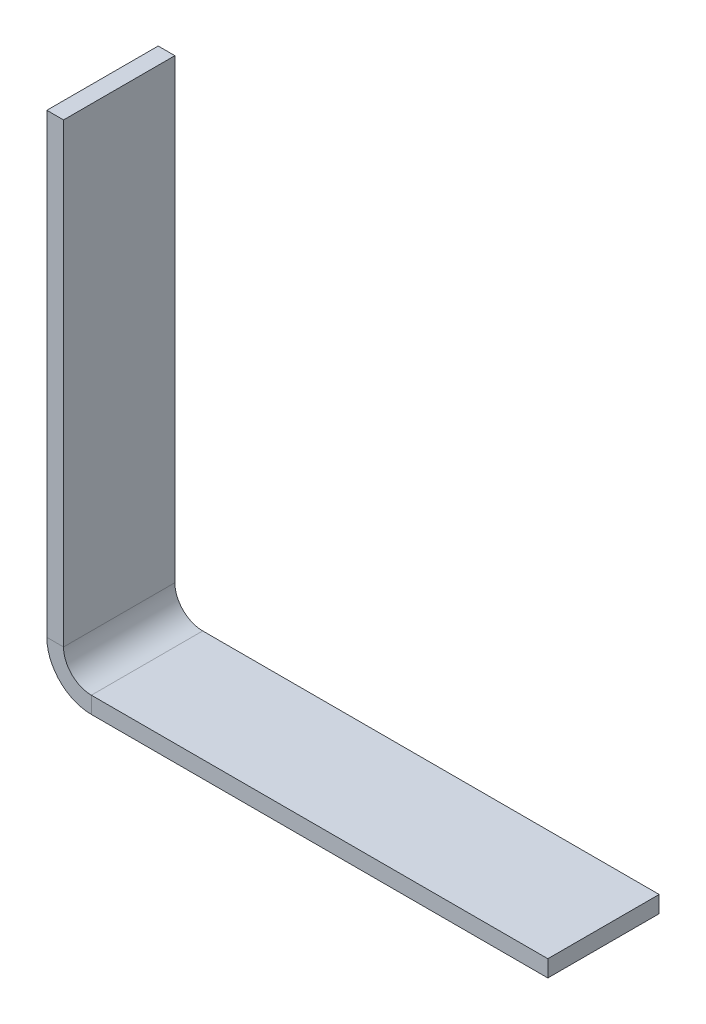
ISO-10303-21;
HEADER;
FILE_DESCRIPTION(('STEP AP214'),'2;1');
FILE_NAME('part.step','',(''),(''),'','','');
FILE_SCHEMA(('AUTOMOTIVE_DESIGN { 1 0 10303 214 1 1 1 1 }'));
ENDSEC;
DATA;
#1=APPLICATION_CONTEXT('core data for automotive mechanical design processes');
#2=APPLICATION_PROTOCOL_DEFINITION('international standard','automotive_design',2000,#1);
#3=PRODUCT_CONTEXT('',#1,'mechanical');
#4=PRODUCT('Part','Part','',(#3));
#5=PRODUCT_RELATED_PRODUCT_CATEGORY('part','',(#4));
#6=PRODUCT_DEFINITION_FORMATION('','',#4);
#7=PRODUCT_DEFINITION_CONTEXT('part definition',#1,'design');
#8=PRODUCT_DEFINITION('design','',#6,#7);
#9=PRODUCT_DEFINITION_SHAPE('','',#8);
#10=(LENGTH_UNIT() NAMED_UNIT(*) SI_UNIT(.MILLI.,.METRE.));
#11=(NAMED_UNIT(*) PLANE_ANGLE_UNIT() SI_UNIT($,.RADIAN.));
#12=(NAMED_UNIT(*) SI_UNIT($,.STERADIAN.) SOLID_ANGLE_UNIT());
#13=UNCERTAINTY_MEASURE_WITH_UNIT(LENGTH_MEASURE(1.E-05),#10,'distance_accuracy_value','');
#14=(GEOMETRIC_REPRESENTATION_CONTEXT(3) GLOBAL_UNCERTAINTY_ASSIGNED_CONTEXT((#13)) GLOBAL_UNIT_ASSIGNED_CONTEXT((#10,
#11,#12)) REPRESENTATION_CONTEXT('',''));
#15=CARTESIAN_POINT('',(0.,0.,0.));
#16=DIRECTION('',(0.,0.,1.));
#17=DIRECTION('',(1.,0.,0.));
#18=AXIS2_PLACEMENT_3D('',#15,#16,#17);
#19=CARTESIAN_POINT('',(0.,8.00000000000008,10.));
#20=DIRECTION('',(0.,0.,1.));
#21=DIRECTION('',(1.,0.,0.));
#22=AXIS2_PLACEMENT_3D('',#19,#20,#21);
#23=PLANE('',#22);
#24=DIRECTION('',(1.,0.,0.));
#25=VECTOR('',#24,1.);
#26=CARTESIAN_POINT('',(0.,8.00000000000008,10.));
#27=LINE('',#26,#25);
#28=CARTESIAN_POINT('',(0.,8.00000000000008,10.));
#29=VERTEX_POINT('',#28);
#30=CARTESIAN_POINT('',(3.,8.00000000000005,10.));
#31=VERTEX_POINT('',#30);
#32=EDGE_CURVE('E11',#29,#31,#27,.T.);
#33=ORIENTED_EDGE('',*,*,#32,.F.);
#34=CARTESIAN_POINT('',(8.,8.00000000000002,10.));
#35=DIRECTION('',(0.,0.,-1.));
#36=DIRECTION('',(-1.,0.,0.));
#37=AXIS2_PLACEMENT_3D('',#34,#35,#36);
#38=CIRCLE('',#37,8.);
#39=CARTESIAN_POINT('',(7.99999999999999,0.,10.));
#40=VERTEX_POINT('',#39);
#41=EDGE_CURVE('E126',#29,#40,#38,.F.);
#42=ORIENTED_EDGE('',*,*,#41,.T.);
#43=DIRECTION('',(0.,-1.,0.));
#44=VECTOR('',#43,1.);
#45=CARTESIAN_POINT('',(7.99999999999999,3.,10.));
#46=LINE('',#45,#44);
#47=CARTESIAN_POINT('',(7.99999999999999,3.,10.));
#48=VERTEX_POINT('',#47);
#49=EDGE_CURVE('E44',#48,#40,#46,.T.);
#50=ORIENTED_EDGE('',*,*,#49,.F.);
#51=CARTESIAN_POINT('',(8.,8.00000000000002,10.));
#52=DIRECTION('',(0.,0.,1.));
#53=DIRECTION('',(1.,0.,0.));
#54=AXIS2_PLACEMENT_3D('',#51,#52,#53);
#55=CIRCLE('',#54,5.);
#56=EDGE_CURVE('E133',#31,#48,#55,.T.);
#57=ORIENTED_EDGE('',*,*,#56,.F.);
#58=EDGE_LOOP('',(#33,#42,#50,#57));
#59=FACE_BOUND('',#58,.T.);
#60=ADVANCED_FACE('F36',(#59),#23,.T.);
#61=CARTESIAN_POINT('',(7.99999999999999,3.,10.));
#62=DIRECTION('',(0.,0.,1.));
#63=DIRECTION('',(1.,0.,0.));
#64=AXIS2_PLACEMENT_3D('',#61,#62,#63);
#65=PLANE('',#64);
#66=DIRECTION('',(0.,-1.,0.));
#67=VECTOR('',#66,1.);
#68=CARTESIAN_POINT('',(0.,90.,10.));
#69=LINE('',#68,#67);
#70=CARTESIAN_POINT('',(0.,90.,10.));
#71=VERTEX_POINT('',#70);
#72=EDGE_CURVE('E121',#71,#29,#69,.T.);
#73=ORIENTED_EDGE('',*,*,#72,.T.);
#74=ORIENTED_EDGE('',*,*,#32,.T.);
#75=DIRECTION('',(0.,-1.,0.));
#76=VECTOR('',#75,1.);
#77=CARTESIAN_POINT('',(3.,90.,10.));
#78=LINE('',#77,#76);
#79=CARTESIAN_POINT('',(3.,90.,10.));
#80=VERTEX_POINT('',#79);
#81=EDGE_CURVE('E131',#80,#31,#78,.T.);
#82=ORIENTED_EDGE('',*,*,#81,.F.);
#83=DIRECTION('',(1.,0.,0.));
#84=VECTOR('',#83,1.);
#85=CARTESIAN_POINT('',(0.,90.,10.));
#86=LINE('',#85,#84);
#87=EDGE_CURVE('E112',#71,#80,#86,.T.);
#88=ORIENTED_EDGE('',*,*,#87,.F.);
#89=EDGE_LOOP('',(#73,#74,#82,#88));
#90=FACE_BOUND('',#89,.T.);
#91=ADVANCED_FACE('F129',(#90),#65,.T.);
#92=CARTESIAN_POINT('',(7.99999999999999,0.,-10.));
#93=DIRECTION('',(0.,0.,-1.));
#94=DIRECTION('',(-1.,0.,0.));
#95=AXIS2_PLACEMENT_3D('',#92,#93,#94);
#96=PLANE('',#95);
#97=DIRECTION('',(0.,1.,0.));
#98=VECTOR('',#97,1.);
#99=CARTESIAN_POINT('',(7.99999999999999,0.,-10.));
#100=LINE('',#99,#98);
#101=CARTESIAN_POINT('',(7.99999999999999,0.,-10.));
#102=VERTEX_POINT('',#101);
#103=CARTESIAN_POINT('',(7.99999999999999,3.,-10.));
#104=VERTEX_POINT('',#103);
#105=EDGE_CURVE('E87',#102,#104,#100,.T.);
#106=ORIENTED_EDGE('',*,*,#105,.F.);
#107=CARTESIAN_POINT('',(8.,8.00000000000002,-10.));
#108=DIRECTION('',(0.,0.,-1.));
#109=DIRECTION('',(-1.,0.,0.));
#110=AXIS2_PLACEMENT_3D('',#107,#108,#109);
#111=CIRCLE('',#110,8.);
#112=CARTESIAN_POINT('',(0.,8.00000000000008,-10.));
#113=VERTEX_POINT('',#112);
#114=EDGE_CURVE('E155',#113,#102,#111,.F.);
#115=ORIENTED_EDGE('',*,*,#114,.F.);
#116=DIRECTION('',(-1.,0.,0.));
#117=VECTOR('',#116,1.);
#118=CARTESIAN_POINT('',(3.,8.00000000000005,-10.));
#119=LINE('',#118,#117);
#120=CARTESIAN_POINT('',(3.,8.00000000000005,-10.));
#121=VERTEX_POINT('',#120);
#122=EDGE_CURVE('E80',#121,#113,#119,.T.);
#123=ORIENTED_EDGE('',*,*,#122,.F.);
#124=CARTESIAN_POINT('',(8.,8.00000000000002,-10.));
#125=DIRECTION('',(0.,0.,1.));
#126=DIRECTION('',(1.,0.,0.));
#127=AXIS2_PLACEMENT_3D('',#124,#125,#126);
#128=CIRCLE('',#127,5.);
#129=EDGE_CURVE('E148',#121,#104,#128,.T.);
#130=ORIENTED_EDGE('',*,*,#129,.T.);
#131=EDGE_LOOP('',(#106,#115,#123,#130));
#132=FACE_BOUND('',#131,.T.);
#133=ADVANCED_FACE('F187',(#132),#96,.T.);
#134=CARTESIAN_POINT('',(3.,8.00000000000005,-10.));
#135=DIRECTION('',(0.,0.,-1.));
#136=DIRECTION('',(-1.,0.,0.));
#137=AXIS2_PLACEMENT_3D('',#134,#135,#136);
#138=PLANE('',#137);
#139=DIRECTION('',(1.,0.,0.));
#140=VECTOR('',#139,1.);
#141=CARTESIAN_POINT('',(0.,0.,-10.));
#142=LINE('',#141,#140);
#143=CARTESIAN_POINT('',(90.,0.,-10.));
#144=VERTEX_POINT('',#143);
#145=EDGE_CURVE('E139',#102,#144,#142,.T.);
#146=ORIENTED_EDGE('',*,*,#145,.F.);
#147=ORIENTED_EDGE('',*,*,#105,.T.);
#148=DIRECTION('',(1.,0.,0.));
#149=VECTOR('',#148,1.);
#150=CARTESIAN_POINT('',(0.,3.,-10.));
#151=LINE('',#150,#149);
#152=CARTESIAN_POINT('',(90.,3.,-10.));
#153=VERTEX_POINT('',#152);
#154=EDGE_CURVE('E145',#104,#153,#151,.T.);
#155=ORIENTED_EDGE('',*,*,#154,.T.);
#156=DIRECTION('',(0.,-1.,0.));
#157=VECTOR('',#156,1.);
#158=CARTESIAN_POINT('',(90.,3.,-10.));
#159=LINE('',#158,#157);
#160=EDGE_CURVE('E142',#153,#144,#159,.T.);
#161=ORIENTED_EDGE('',*,*,#160,.T.);
#162=EDGE_LOOP('',(#146,#147,#155,#161));
#163=FACE_BOUND('',#162,.T.);
#164=ADVANCED_FACE('F174',(#163),#138,.T.);
#165=CARTESIAN_POINT('',(0.,0.,10.));
#166=DIRECTION('',(0.,1.,0.));
#167=DIRECTION('',(0.,0.,1.));
#168=AXIS2_PLACEMENT_3D('',#165,#166,#167);
#169=PLANE('',#168);
#170=ORIENTED_EDGE('',*,*,#145,.T.);
#171=DIRECTION('',(0.,0.,-1.));
#172=VECTOR('',#171,1.);
#173=CARTESIAN_POINT('',(90.,0.,10.));
#174=LINE('',#173,#172);
#175=CARTESIAN_POINT('',(90.,0.,10.));
#176=VERTEX_POINT('',#175);
#177=EDGE_CURVE('E169',#176,#144,#174,.T.);
#178=ORIENTED_EDGE('',*,*,#177,.F.);
#179=DIRECTION('',(1.,0.,0.));
#180=VECTOR('',#179,1.);
#181=CARTESIAN_POINT('',(0.,0.,10.));
#182=LINE('',#181,#180);
#183=EDGE_CURVE('E93',#40,#176,#182,.T.);
#184=ORIENTED_EDGE('',*,*,#183,.F.);
#185=DIRECTION('',(0.,0.,-1.));
#186=VECTOR('',#185,1.);
#187=CARTESIAN_POINT('',(7.99999999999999,0.,10.));
#188=LINE('',#187,#186);
#189=EDGE_CURVE('E138',#40,#102,#188,.T.);
#190=ORIENTED_EDGE('',*,*,#189,.T.);
#191=EDGE_LOOP('',(#170,#178,#184,#190));
#192=FACE_BOUND('',#191,.T.);
#193=ADVANCED_FACE('F223',(#192),#169,.F.);
#194=CARTESIAN_POINT('',(90.,3.,10.));
#195=DIRECTION('',(1.,0.,0.));
#196=DIRECTION('',(0.,0.,-1.));
#197=AXIS2_PLACEMENT_3D('',#194,#195,#196);
#198=PLANE('',#197);
#199=ORIENTED_EDGE('',*,*,#160,.F.);
#200=DIRECTION('',(0.,0.,-1.));
#201=VECTOR('',#200,1.);
#202=CARTESIAN_POINT('',(90.,3.,10.));
#203=LINE('',#202,#201);
#204=CARTESIAN_POINT('',(90.,3.,10.));
#205=VERTEX_POINT('',#204);
#206=EDGE_CURVE('E167',#205,#153,#203,.T.);
#207=ORIENTED_EDGE('',*,*,#206,.F.);
#208=DIRECTION('',(0.,-1.,0.));
#209=VECTOR('',#208,1.);
#210=CARTESIAN_POINT('',(90.,3.,10.));
#211=LINE('',#210,#209);
#212=EDGE_CURVE('E193',#205,#176,#211,.T.);
#213=ORIENTED_EDGE('',*,*,#212,.T.);
#214=ORIENTED_EDGE('',*,*,#177,.T.);
#215=EDGE_LOOP('',(#199,#207,#213,#214));
#216=FACE_BOUND('',#215,.T.);
#217=ADVANCED_FACE('F199',(#216),#198,.T.);
#218=CARTESIAN_POINT('',(0.,3.,10.));
#219=DIRECTION('',(0.,1.,0.));
#220=DIRECTION('',(0.,0.,1.));
#221=AXIS2_PLACEMENT_3D('',#218,#219,#220);
#222=PLANE('',#221);
#223=ORIENTED_EDGE('',*,*,#154,.F.);
#224=DIRECTION('',(0.,0.,-1.));
#225=VECTOR('',#224,1.);
#226=CARTESIAN_POINT('',(7.99999999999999,3.,10.));
#227=LINE('',#226,#225);
#228=EDGE_CURVE('E164',#48,#104,#227,.T.);
#229=ORIENTED_EDGE('',*,*,#228,.F.);
#230=DIRECTION('',(1.,0.,0.));
#231=VECTOR('',#230,1.);
#232=CARTESIAN_POINT('',(0.,3.,10.));
#233=LINE('',#232,#231);
#234=EDGE_CURVE('E192',#48,#205,#233,.T.);
#235=ORIENTED_EDGE('',*,*,#234,.T.);
#236=ORIENTED_EDGE('',*,*,#206,.T.);
#237=EDGE_LOOP('',(#223,#229,#235,#236));
#238=FACE_BOUND('',#237,.T.);
#239=ADVANCED_FACE('F185',(#238),#222,.T.);
#240=CARTESIAN_POINT('',(8.,8.00000000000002,10.));
#241=DIRECTION('',(0.,0.,-1.));
#242=DIRECTION('',(-1.,0.,0.));
#243=AXIS2_PLACEMENT_3D('',#240,#241,#242);
#244=CYLINDRICAL_SURFACE('',#243,5.);
#245=ORIENTED_EDGE('',*,*,#129,.F.);
#246=DIRECTION('',(0.,0.,-1.));
#247=VECTOR('',#246,1.);
#248=CARTESIAN_POINT('',(3.,8.00000000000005,10.));
#249=LINE('',#248,#247);
#250=EDGE_CURVE('E161',#31,#121,#249,.T.);
#251=ORIENTED_EDGE('',*,*,#250,.F.);
#252=ORIENTED_EDGE('',*,*,#56,.T.);
#253=ORIENTED_EDGE('',*,*,#228,.T.);
#254=EDGE_LOOP('',(#245,#251,#252,#253));
#255=FACE_BOUND('',#254,.T.);
#256=ADVANCED_FACE('F180',(#255),#244,.F.);
#257=CARTESIAN_POINT('',(3.,90.,10.));
#258=DIRECTION('',(1.,0.,0.));
#259=DIRECTION('',(0.,1.,0.));
#260=AXIS2_PLACEMENT_3D('',#257,#258,#259);
#261=PLANE('',#260);
#262=DIRECTION('',(0.,-1.,0.));
#263=VECTOR('',#262,1.);
#264=CARTESIAN_POINT('',(3.,90.,-10.));
#265=LINE('',#264,#263);
#266=CARTESIAN_POINT('',(3.,90.,-10.));
#267=VERTEX_POINT('',#266);
#268=EDGE_CURVE('E150',#267,#121,#265,.T.);
#269=ORIENTED_EDGE('',*,*,#268,.F.);
#270=DIRECTION('',(0.,0.,-1.));
#271=VECTOR('',#270,1.);
#272=CARTESIAN_POINT('',(3.,90.,10.));
#273=LINE('',#272,#271);
#274=EDGE_CURVE('E116',#80,#267,#273,.T.);
#275=ORIENTED_EDGE('',*,*,#274,.F.);
#276=ORIENTED_EDGE('',*,*,#81,.T.);
#277=ORIENTED_EDGE('',*,*,#250,.T.);
#278=EDGE_LOOP('',(#269,#275,#276,#277));
#279=FACE_BOUND('',#278,.T.);
#280=ADVANCED_FACE('F190',(#279),#261,.T.);
#281=CARTESIAN_POINT('',(0.,90.,10.));
#282=DIRECTION('',(0.,1.,0.));
#283=DIRECTION('',(0.,0.,1.));
#284=AXIS2_PLACEMENT_3D('',#281,#282,#283);
#285=PLANE('',#284);
#286=DIRECTION('',(1.,0.,0.));
#287=VECTOR('',#286,1.);
#288=CARTESIAN_POINT('',(0.,90.,-10.));
#289=LINE('',#288,#287);
#290=CARTESIAN_POINT('',(0.,90.,-10.));
#291=VERTEX_POINT('',#290);
#292=EDGE_CURVE('E114',#291,#267,#289,.T.);
#293=ORIENTED_EDGE('',*,*,#292,.F.);
#294=DIRECTION('',(0.,0.,-1.));
#295=VECTOR('',#294,1.);
#296=CARTESIAN_POINT('',(0.,90.,10.));
#297=LINE('',#296,#295);
#298=EDGE_CURVE('E108',#71,#291,#297,.T.);
#299=ORIENTED_EDGE('',*,*,#298,.F.);
#300=ORIENTED_EDGE('',*,*,#87,.T.);
#301=ORIENTED_EDGE('',*,*,#274,.T.);
#302=EDGE_LOOP('',(#293,#299,#300,#301));
#303=FACE_BOUND('',#302,.T.);
#304=ADVANCED_FACE('F110',(#303),#285,.T.);
#305=CARTESIAN_POINT('',(0.,90.,10.));
#306=DIRECTION('',(1.,0.,0.));
#307=DIRECTION('',(0.,1.,0.));
#308=AXIS2_PLACEMENT_3D('',#305,#306,#307);
#309=PLANE('',#308);
#310=DIRECTION('',(0.,-1.,0.));
#311=VECTOR('',#310,1.);
#312=CARTESIAN_POINT('',(0.,90.,-10.));
#313=LINE('',#312,#311);
#314=EDGE_CURVE('E153',#291,#113,#313,.T.);
#315=ORIENTED_EDGE('',*,*,#314,.T.);
#316=DIRECTION('',(0.,0.,-1.));
#317=VECTOR('',#316,1.);
#318=CARTESIAN_POINT('',(0.,8.00000000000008,10.));
#319=LINE('',#318,#317);
#320=EDGE_CURVE('E117',#29,#113,#319,.T.);
#321=ORIENTED_EDGE('',*,*,#320,.F.);
#322=ORIENTED_EDGE('',*,*,#72,.F.);
#323=ORIENTED_EDGE('',*,*,#298,.T.);
#324=EDGE_LOOP('',(#315,#321,#322,#323));
#325=FACE_BOUND('',#324,.T.);
#326=ADVANCED_FACE('F122',(#325),#309,.F.);
#327=CARTESIAN_POINT('',(8.,8.00000000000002,10.));
#328=DIRECTION('',(0.,0.,-1.));
#329=DIRECTION('',(-1.,0.,0.));
#330=AXIS2_PLACEMENT_3D('',#327,#328,#329);
#331=CYLINDRICAL_SURFACE('',#330,8.);
#332=ORIENTED_EDGE('',*,*,#114,.T.);
#333=ORIENTED_EDGE('',*,*,#189,.F.);
#334=ORIENTED_EDGE('',*,*,#41,.F.);
#335=ORIENTED_EDGE('',*,*,#320,.T.);
#336=EDGE_LOOP('',(#332,#333,#334,#335));
#337=FACE_BOUND('',#336,.T.);
#338=ADVANCED_FACE('F203',(#337),#331,.T.);
#339=CARTESIAN_POINT('',(8.,8.00000000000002,10.));
#340=DIRECTION('',(0.,0.,1.));
#341=DIRECTION('',(1.,0.,0.));
#342=AXIS2_PLACEMENT_3D('',#339,#340,#341);
#343=PLANE('',#342);
#344=ORIENTED_EDGE('',*,*,#183,.T.);
#345=ORIENTED_EDGE('',*,*,#212,.F.);
#346=ORIENTED_EDGE('',*,*,#234,.F.);
#347=ORIENTED_EDGE('',*,*,#49,.T.);
#348=EDGE_LOOP('',(#344,#345,#346,#347));
#349=FACE_BOUND('',#348,.T.);
#350=ADVANCED_FACE('F200',(#349),#343,.T.);
#351=CARTESIAN_POINT('',(8.,8.00000000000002,-10.));
#352=DIRECTION('',(0.,0.,1.));
#353=DIRECTION('',(1.,0.,0.));
#354=AXIS2_PLACEMENT_3D('',#351,#352,#353);
#355=PLANE('',#354);
#356=ORIENTED_EDGE('',*,*,#268,.T.);
#357=ORIENTED_EDGE('',*,*,#122,.T.);
#358=ORIENTED_EDGE('',*,*,#314,.F.);
#359=ORIENTED_EDGE('',*,*,#292,.T.);
#360=EDGE_LOOP('',(#356,#357,#358,#359));
#361=FACE_BOUND('',#360,.T.);
#362=ADVANCED_FACE('F202',(#361),#355,.F.);
#363=CLOSED_SHELL('',(#60,#91,#133,#164,#193,#217,#239,#256,#280,#304,#326,#338,#350,#362));
#364=MANIFOLD_SOLID_BREP('B2',#363);
#365=ADVANCED_BREP_SHAPE_REPRESENTATION('',(#18,#364),#14);
#366=SHAPE_DEFINITION_REPRESENTATION(#9,#365);
ENDSEC;
END-ISO-10303-21;
